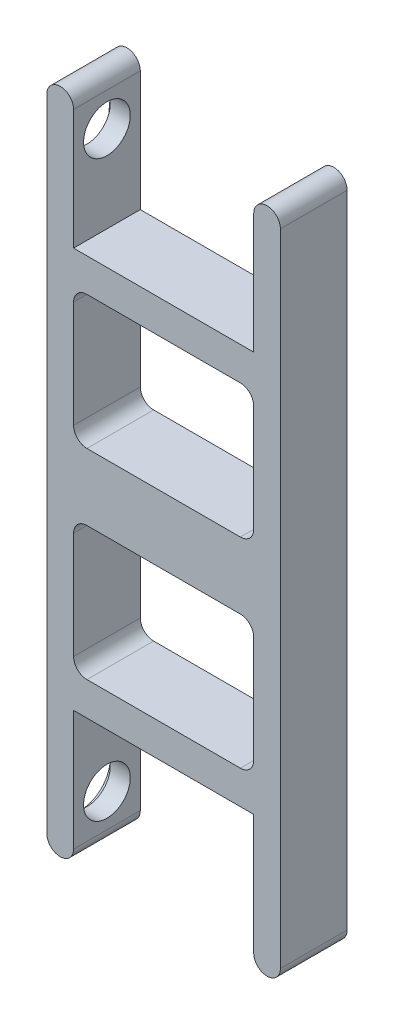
from build123d import *

# Parameters (mm, degrees)
SKETCH1_W           = 35
SKETCH1_H           = 100
BOSS_EXTRUDE1_DEPTH = 10
SKETCH2_W           = 27
SKETCH2_H           = 20
CUT_EXTRUDE1_DEPTH  = 54.909646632
FILLET1_RADIUS      = 2
FILLET1_LENGTH      = 10
FILLET2_RADIUS      = 2
FILLET2_LENGTH      = 10
FILLET3_RADIUS      = 2
FILLET3_LENGTH      = 10
FILLET4_RADIUS      = 2
FILLET4_LENGTH      = 10
SKETCH3_W           = 27
SKETCH3_H           = 20
CUT_EXTRUDE2_DEPTH  = 10
FILLET5_R           = 2
CUT_EXTRUDE3_REACH  = 63.847
SKETCH4_R           = 3.5
CUT_EXTRUDE4_DEPTH  = 1


with BuildPart() as part:
    # Sketch1 → Boss-Extrude1 (new body)
    with BuildSketch(Plane.XY):
        Rectangle(SKETCH1_W, SKETCH1_H)
    extrude(amount=BOSS_EXTRUDE1_DEPTH)

    # Sketch2 → Cut-Extrude1 (cut, through all)
    with BuildSketch(Plane.XY.offset(10)):
        with Locations((0, 40)):
            Rectangle(SKETCH2_W, SKETCH2_H)
        with Locations((0, -40)):
            Rectangle(SKETCH2_W, SKETCH2_H)
    extrude(amount=-CUT_EXTRUDE1_DEPTH, mode=Mode.SUBTRACT)

    # Fillet1: full round fillet: the end face becomes a half cylinder, R = half its width
    fillet1_face = Plane((-15.5, 50, 5), x_dir=(0, 0, -1), z_dir=(0, 1, 0))  # on the end face: x along it, z out of the body
    fillet1_slab = fillet1_face.offset(-FILLET1_RADIUS / 2) * Box(FILLET1_LENGTH, 2 * FILLET1_RADIUS, FILLET1_RADIUS, mode=Mode.PRIVATE)  # the body's end, R deep
    fillet1_round = Plane((-15.5, 48, 5), x_dir=(0, 1, 0), z_dir=(0, 0, -1)) * Cylinder(FILLET1_RADIUS, FILLET1_LENGTH, mode=Mode.PRIVATE)  # its axis R under the face
    add(fillet1_slab - fillet1_round, mode=Mode.SUBTRACT)

    # Fillet2: full round fillet: the end face becomes a half cylinder, R = half its width
    fillet2_face = Plane((15.5, 50, 5), x_dir=(0, 0, 1), z_dir=(0, 1, 0))  # on the end face: x along it, z out of the body
    fillet2_slab = fillet2_face.offset(-FILLET2_RADIUS / 2) * Box(FILLET2_LENGTH, 2 * FILLET2_RADIUS, FILLET2_RADIUS, mode=Mode.PRIVATE)  # the body's end, R deep
    fillet2_round = Plane((15.5, 48, 5), x_dir=(0, 1, 0), z_dir=(0, 0, 1)) * Cylinder(FILLET2_RADIUS, FILLET2_LENGTH, mode=Mode.PRIVATE)  # its axis R under the face
    add(fillet2_slab - fillet2_round, mode=Mode.SUBTRACT)

    # Fillet3: full round fillet: the end face becomes a half cylinder, R = half its width
    fillet3_face = Plane((-15.5, -50, 5), x_dir=(0, 0, 1), z_dir=(0, -1, 0))  # on the end face: x along it, z out of the body
    fillet3_slab = fillet3_face.offset(-FILLET3_RADIUS / 2) * Box(FILLET3_LENGTH, 2 * FILLET3_RADIUS, FILLET3_RADIUS, mode=Mode.PRIVATE)  # the body's end, R deep
    fillet3_round = Plane((-15.5, -48, 5), x_dir=(0, -1, 0), z_dir=(0, 0, 1)) * Cylinder(FILLET3_RADIUS, FILLET3_LENGTH, mode=Mode.PRIVATE)  # its axis R under the face
    add(fillet3_slab - fillet3_round, mode=Mode.SUBTRACT)

    # Fillet4: full round fillet: the end face becomes a half cylinder, R = half its width
    fillet4_face = Plane((15.5, -50, 5), x_dir=(0, 0, -1), z_dir=(0, -1, 0))  # on the end face: x along it, z out of the body
    fillet4_slab = fillet4_face.offset(-FILLET4_RADIUS / 2) * Box(FILLET4_LENGTH, 2 * FILLET4_RADIUS, FILLET4_RADIUS, mode=Mode.PRIVATE)  # the body's end, R deep
    fillet4_round = Plane((15.5, -48, 5), x_dir=(0, -1, 0), z_dir=(0, 0, -1)) * Cylinder(FILLET4_RADIUS, FILLET4_LENGTH, mode=Mode.PRIVATE)  # its axis R under the face
    add(fillet4_slab - fillet4_round, mode=Mode.SUBTRACT)

    # Sketch3 → Cut-Extrude2 (cut)
    with BuildSketch(Plane(origin=(0, 0, 0), x_dir=(-1, 0, 0), z_dir=(0, 0, -1))):
        with Locations((0, -15)):
            Rectangle(SKETCH3_W, SKETCH3_H)
        with Locations((0, 15)):
            Rectangle(SKETCH3_W, SKETCH3_H)
    extrude(amount=-CUT_EXTRUDE2_DEPTH, mode=Mode.SUBTRACT)

    # Fillet5
    fillet5_edges = [part.edges().sort_by_distance(p)[0] for p in [
        (-13.5, -5, 5),
        (-13.5, -25, 5),
        (13.5, -25, 5),
        (13.5, -5, 5),
        (-13.5, 25, 5),
        (-13.5, 5, 5),
        (13.5, 5, 5),
        (13.5, 25, 5),
    ]]
    fillet(fillet5_edges, radius=FILLET5_R)

    # Sketch4 → Cut-Extrude3 (cut, up to next)
    with BuildSketch(Plane.ZY.offset(17.5), mode=Mode.PRIVATE) as cut_extrude3_sk1:
        with Locations((5, -43)):
            Circle(SKETCH4_R)
    cut_extrude3_tool1 = extrude(cut_extrude3_sk1.sketch, amount=-CUT_EXTRUDE3_REACH, mode=Mode.PRIVATE) & part.part
    # Sketch4 → Cut-Extrude3 (cut, up to next)
    with BuildSketch(Plane.ZY.offset(17.5), mode=Mode.PRIVATE) as cut_extrude3_sk2:
        with Locations((5, 43)):
            Circle(SKETCH4_R)
    cut_extrude3_tool2 = extrude(cut_extrude3_sk2.sketch, amount=-CUT_EXTRUDE3_REACH, mode=Mode.PRIVATE) & part.part
    add(cut_extrude3_tool1.solids().sort_by_distance((-17.5, -43, 5))[0], mode=Mode.SUBTRACT)
    add(cut_extrude3_tool2.solids().sort_by_distance((-17.5, 43, 5))[0], mode=Mode.SUBTRACT)

    # Sketch5 → Cut-Extrude4 (cut)
    with BuildSketch(Plane.ZY.offset(17.5)):
        with BuildLine():
            Line((9.5, -43), (8, -28))
            ThreePointArc((8, -28), (5, -25), (2, -28))
            Line((2, -28), (0.5, -43))
            ThreePointArc((0.5, -43), (5, -47.5), (9.5, -43))
        make_face()
        with BuildLine():
            Line((0.5, 43), (2, 28))
            ThreePointArc((2, 28), (5, 25), (8, 28))
            Line((8, 28), (9.5, 43))
            ThreePointArc((9.5, 43), (5, 47.5), (0.5, 43))
        make_face()
    extrude(amount=-CUT_EXTRUDE4_DEPTH, mode=Mode.SUBTRACT)


solid = part.part
